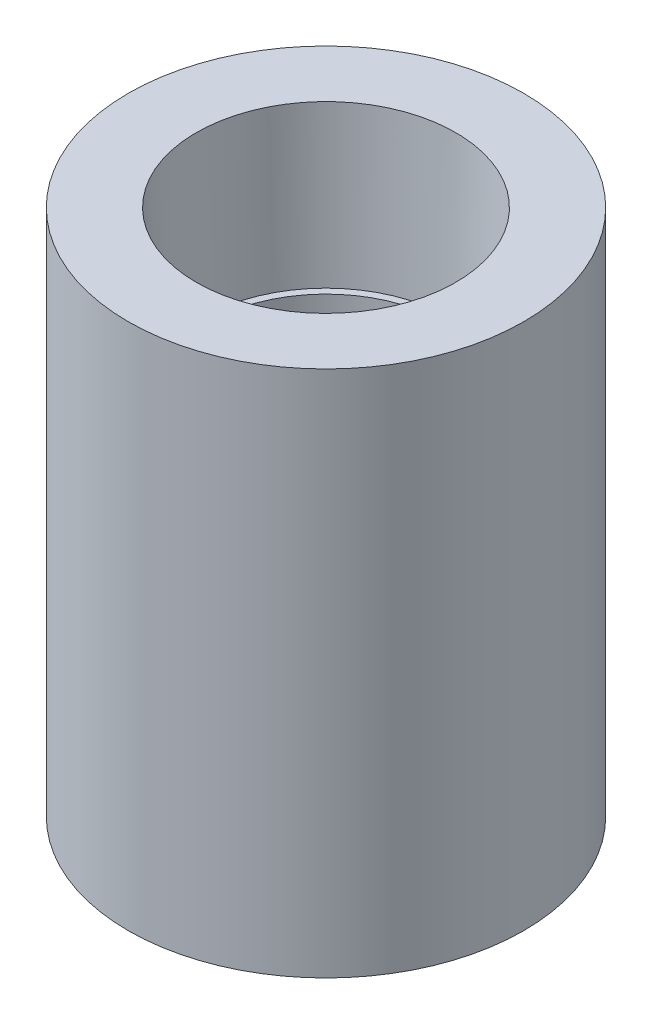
ISO-10303-21;
HEADER;
FILE_DESCRIPTION(('STEP AP214'),'2;1');
FILE_NAME('part.step','',(''),(''),'','','');
FILE_SCHEMA(('AUTOMOTIVE_DESIGN { 1 0 10303 214 1 1 1 1 }'));
ENDSEC;
DATA;
#1=APPLICATION_CONTEXT('core data for automotive mechanical design processes');
#2=APPLICATION_PROTOCOL_DEFINITION('international standard','automotive_design',2000,#1);
#3=PRODUCT_CONTEXT('',#1,'mechanical');
#4=PRODUCT('Part','Part','',(#3));
#5=PRODUCT_RELATED_PRODUCT_CATEGORY('part','',(#4));
#6=PRODUCT_DEFINITION_FORMATION('','',#4);
#7=PRODUCT_DEFINITION_CONTEXT('part definition',#1,'design');
#8=PRODUCT_DEFINITION('design','',#6,#7);
#9=PRODUCT_DEFINITION_SHAPE('','',#8);
#10=(LENGTH_UNIT() NAMED_UNIT(*) SI_UNIT(.MILLI.,.METRE.));
#11=(NAMED_UNIT(*) PLANE_ANGLE_UNIT() SI_UNIT($,.RADIAN.));
#12=(NAMED_UNIT(*) SI_UNIT($,.STERADIAN.) SOLID_ANGLE_UNIT());
#13=UNCERTAINTY_MEASURE_WITH_UNIT(LENGTH_MEASURE(1.E-05),#10,'distance_accuracy_value','');
#14=(GEOMETRIC_REPRESENTATION_CONTEXT(3) GLOBAL_UNCERTAINTY_ASSIGNED_CONTEXT((#13)) GLOBAL_UNIT_ASSIGNED_CONTEXT((#10,
#11,#12)) REPRESENTATION_CONTEXT('',''));
#15=CARTESIAN_POINT('',(0.,0.,0.));
#16=DIRECTION('',(0.,0.,1.));
#17=DIRECTION('',(1.,0.,0.));
#18=AXIS2_PLACEMENT_3D('',#15,#16,#17);
#19=CARTESIAN_POINT('',(0.,40.,0.));
#20=DIRECTION('',(0.,-1.,0.));
#21=DIRECTION('',(0.,0.,-1.));
#22=AXIS2_PLACEMENT_3D('',#19,#20,#21);
#23=CYLINDRICAL_SURFACE('',#22,15.);
#24=CARTESIAN_POINT('',(0.,40.,0.));
#25=DIRECTION('',(0.,1.,0.));
#26=DIRECTION('',(0.,0.,1.));
#27=AXIS2_PLACEMENT_3D('',#24,#25,#26);
#28=CIRCLE('',#27,15.);
#29=CARTESIAN_POINT('',(0.,40.,15.));
#30=VERTEX_POINT('',#29);
#31=EDGE_CURVE('E11',#30,#30,#28,.T.);
#32=ORIENTED_EDGE('',*,*,#31,.F.);
#33=EDGE_LOOP('',(#32));
#34=FACE_BOUND('',#33,.T.);
#35=CARTESIAN_POINT('',(0.,0.,0.));
#36=DIRECTION('',(0.,1.,0.));
#37=DIRECTION('',(0.,0.,1.));
#38=AXIS2_PLACEMENT_3D('',#35,#36,#37);
#39=CIRCLE('',#38,15.);
#40=CARTESIAN_POINT('',(0.,0.,15.));
#41=VERTEX_POINT('',#40);
#42=EDGE_CURVE('E38',#41,#41,#39,.T.);
#43=ORIENTED_EDGE('',*,*,#42,.T.);
#44=EDGE_LOOP('',(#43));
#45=FACE_BOUND('',#44,.T.);
#46=ADVANCED_FACE('F35',(#34,#45),#23,.T.);
#47=CARTESIAN_POINT('',(0.,40.,0.));
#48=DIRECTION('',(0.,1.,0.));
#49=DIRECTION('',(0.,0.,1.));
#50=AXIS2_PLACEMENT_3D('',#47,#48,#49);
#51=PLANE('',#50);
#52=CARTESIAN_POINT('',(0.,40.,0.));
#53=DIRECTION('',(0.,1.,0.));
#54=DIRECTION('',(0.,0.,1.));
#55=AXIS2_PLACEMENT_3D('',#52,#53,#54);
#56=CIRCLE('',#55,9.8390202);
#57=CARTESIAN_POINT('',(0.,40.,9.8390202));
#58=VERTEX_POINT('',#57);
#59=EDGE_CURVE('E63',#58,#58,#56,.T.);
#60=ORIENTED_EDGE('',*,*,#59,.F.);
#61=EDGE_LOOP('',(#60));
#62=FACE_BOUND('',#61,.T.);
#63=ORIENTED_EDGE('',*,*,#31,.T.);
#64=EDGE_LOOP('',(#63));
#65=FACE_BOUND('',#64,.T.);
#66=ADVANCED_FACE('F69',(#62,#65),#51,.T.);
#67=CARTESIAN_POINT('',(0.,0.,0.));
#68=DIRECTION('',(0.,1.,0.));
#69=DIRECTION('',(0.,0.,1.));
#70=AXIS2_PLACEMENT_3D('',#67,#68,#69);
#71=PLANE('',#70);
#72=ORIENTED_EDGE('',*,*,#42,.F.);
#73=EDGE_LOOP('',(#72));
#74=FACE_BOUND('',#73,.T.);
#75=ADVANCED_FACE('F48',(#74),#71,.F.);
#76=CARTESIAN_POINT('',(0.,20.,0.));
#77=DIRECTION('',(0.,1.,0.));
#78=DIRECTION('',(0.,0.,1.));
#79=AXIS2_PLACEMENT_3D('',#76,#77,#78);
#80=CONICAL_SURFACE('',#79,8.9281,1.0471975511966);
#81=CARTESIAN_POINT('',(0.,14.8453590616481,0.));
#82=VERTEX_POINT('',#81);
#83=VERTEX_LOOP('',#82);
#84=FACE_BOUND('',#83,.T.);
#85=CARTESIAN_POINT('',(0.,20.,0.));
#86=DIRECTION('',(0.,1.,0.));
#87=DIRECTION('',(0.,0.,1.));
#88=AXIS2_PLACEMENT_3D('',#85,#86,#87);
#89=CIRCLE('',#88,8.9281);
#90=CARTESIAN_POINT('',(0.,20.,8.9281));
#91=VERTEX_POINT('',#90);
#92=EDGE_CURVE('E52',#91,#91,#89,.T.);
#93=ORIENTED_EDGE('',*,*,#92,.T.);
#94=EDGE_LOOP('',(#93));
#95=FACE_BOUND('',#94,.T.);
#96=ADVANCED_FACE('F44',(#84,#95),#80,.F.);
#97=CARTESIAN_POINT('',(0.,40.,0.));
#98=DIRECTION('',(0.,1.,0.));
#99=DIRECTION('',(0.,0.,1.));
#100=AXIS2_PLACEMENT_3D('',#97,#98,#99);
#101=CYLINDRICAL_SURFACE('',#100,8.9281);
#102=ORIENTED_EDGE('',*,*,#92,.F.);
#103=EDGE_LOOP('',(#102));
#104=FACE_BOUND('',#103,.T.);
#105=CARTESIAN_POINT('',(0.,28.,0.));
#106=DIRECTION('',(0.,1.,0.));
#107=DIRECTION('',(0.,0.,1.));
#108=AXIS2_PLACEMENT_3D('',#105,#106,#107);
#109=CIRCLE('',#108,8.9281);
#110=CARTESIAN_POINT('',(0.,28.,8.9281));
#111=VERTEX_POINT('',#110);
#112=EDGE_CURVE('E54',#111,#111,#109,.T.);
#113=ORIENTED_EDGE('',*,*,#112,.T.);
#114=EDGE_LOOP('',(#113));
#115=FACE_BOUND('',#114,.T.);
#116=ADVANCED_FACE('F47',(#104,#115),#101,.F.);
#117=CARTESIAN_POINT('',(8.9281,28.,0.));
#118=DIRECTION('',(0.,-1.,0.));
#119=DIRECTION('',(0.,0.,-1.));
#120=AXIS2_PLACEMENT_3D('',#117,#118,#119);
#121=PLANE('',#120);
#122=ORIENTED_EDGE('',*,*,#112,.F.);
#123=EDGE_LOOP('',(#122));
#124=FACE_BOUND('',#123,.T.);
#125=CARTESIAN_POINT('',(0.,28.,0.));
#126=DIRECTION('',(0.,1.,0.));
#127=DIRECTION('',(0.,0.,1.));
#128=AXIS2_PLACEMENT_3D('',#125,#126,#127);
#129=CIRCLE('',#128,9.47972412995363);
#130=CARTESIAN_POINT('',(0.,28.,9.47972412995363));
#131=VERTEX_POINT('',#130);
#132=EDGE_CURVE('E58',#131,#131,#129,.T.);
#133=ORIENTED_EDGE('',*,*,#132,.T.);
#134=EDGE_LOOP('',(#133));
#135=FACE_BOUND('',#134,.T.);
#136=ADVANCED_FACE('F85',(#124,#135),#121,.F.);
#137=CARTESIAN_POINT('',(0.,40.,0.));
#138=DIRECTION('',(0.,1.,0.));
#139=DIRECTION('',(0.,0.,1.));
#140=AXIS2_PLACEMENT_3D('',#137,#138,#139);
#141=CONICAL_SURFACE('',#140,9.8390202,0.0299323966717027);
#142=ORIENTED_EDGE('',*,*,#132,.F.);
#143=EDGE_LOOP('',(#142));
#144=FACE_BOUND('',#143,.T.);
#145=ORIENTED_EDGE('',*,*,#59,.T.);
#146=EDGE_LOOP('',(#145));
#147=FACE_BOUND('',#146,.T.);
#148=ADVANCED_FACE('F67',(#144,#147),#141,.F.);
#149=CLOSED_SHELL('',(#46,#66,#75,#96,#116,#136,#148));
#150=MANIFOLD_SOLID_BREP('B2',#149);
#151=ADVANCED_BREP_SHAPE_REPRESENTATION('',(#18,#150),#14);
#152=SHAPE_DEFINITION_REPRESENTATION(#9,#151);
ENDSEC;
END-ISO-10303-21;
